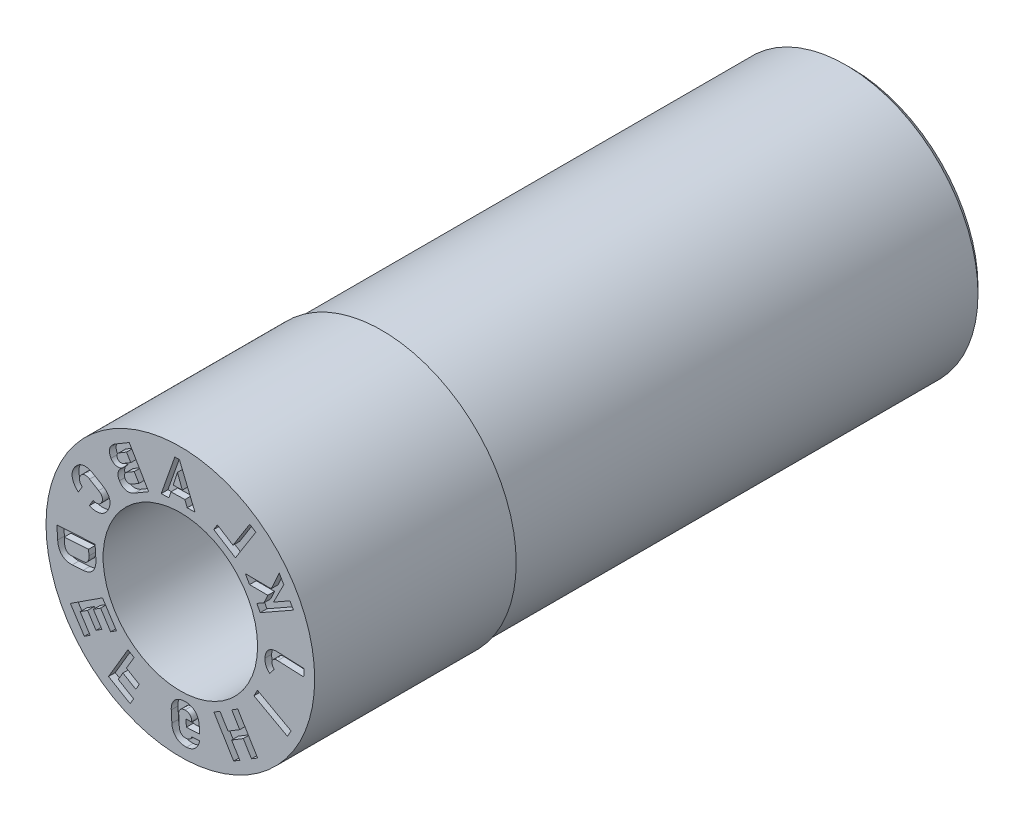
from build123d import *

# Parameters (mm, degrees)
SKETCH4_W          = 14
SKETCH4_H          = 1
CUT_EXTRUDE1_DEPTH = 0.2
CUT_EXTRUDE2_DEPTH = 2


with BuildPart() as part:
    # Sketch1 → Revolve1 (revolve)
    with BuildSketch(Plane(origin=(0, 0, 0), x_dir=(0, 0, -1), z_dir=(1, 0, 0)), mode=Mode.PRIVATE) as revolve1_sk:
        Polygon((0, 4), (0, 2.3), (4, 2.3), (4, 1.25), (16, 1.25), (16, 2), (20, 2), (20, 3.75), (19.75, 4), align=None)
    revolve(revolve1_sk.sketch.rotate(Axis((0, 0, 3.797909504), (0, 0, -1)), 90), axis=Axis((0, 0, 3.797909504), (0, 0, -1)))

    # Sketch4 → Cut-Revolve1 (revolve, cut)
    with BuildSketch(Plane(origin=(0, 0, 0), x_dir=(0, 0, -1), z_dir=(1, 0, 0)), mode=Mode.PRIVATE) as cut_revolve1_sk:
        with Locations((13, 4.435)):
            Rectangle(SKETCH4_W, SKETCH4_H)
    revolve(cut_revolve1_sk.sketch.rotate(Axis((0, 0, 0), (0, 0, -1)), 90), axis=Axis((0, 0, 0), (0, 0, -1)), mode=Mode.SUBTRACT)

    # Sketch2 → Cut-Extrude1 (cut)
    # profile 1 of 12: a face of its own
    with BuildSketch(Plane.XY):
        Polygon((2.773120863, 1.377822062), (3.079891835, 1.977487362), (2.946777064, 2.211889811), (2.705137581, 1.687046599), (1.935571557, 1.693051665), (2.06078152, 1.472021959), (2.60503678, 1.469626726), (2.48840548, 1.216302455), (2.274655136, 1.095041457), (2.380320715, 0.908932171), (3.368128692, 1.469317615), (3.262463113, 1.655426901), align=None)
    # profile 2 of 12: a face of its own
    with BuildSketch(Plane.XY):
        Polygon((2.246873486, 2.917239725), (2.065148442, 3.031646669), (1.568092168, 2.242200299), (1.103482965, 2.534632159), (0.993199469, 2.3594147), (1.639564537, 1.952685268), align=None)
    # profile 3 of 12: a face of its own
    with BuildSketch(Plane.XY):
        Polygon((-2.589112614, -1.491049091), (-2.374599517, -1.351703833), (-2.075388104, -1.812155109), (-1.901737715, -1.699287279), (-2.31797915, -1.058389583), (-3.274642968, -1.679827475), (-2.858401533, -2.320725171), (-2.684751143, -2.207857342), (-2.983901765, -1.747499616), (-2.762793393, -1.603870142), (-2.510613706, -1.992053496), (-2.336963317, -1.879185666), align=None)
    # profile 4 of 12: a face of its own
    with BuildSketch(Plane.XY):
        Polygon((-0.028216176, 3.654319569), (-0.164072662, 3.650803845), (-0.56971503, 2.504084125), (-0.339192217, 2.509922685), (-0.280064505, 2.693516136), (0.136084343, 2.703959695), (0.204476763, 2.523766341), (0.434768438, 2.529593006), align=None)
        Polygon((-0.08722094, 3.292301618), (0.058500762, 2.90836898), (-0.213064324, 2.901553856), align=None, mode=Mode.SUBTRACT)
    # profile 5 of 12: a face of its own
    with BuildSketch(Plane.XY):
        Polygon((-1.605863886, -2.514843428), (-1.376689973, -2.126418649), (-1.561086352, -2.017691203), (-2.138499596, -2.996343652), (-1.495861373, -3.375497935), (-1.39091023, -3.197675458), (-1.849213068, -2.927293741), (-1.710628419, -2.692407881), (-1.326151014, -2.919119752), (-1.221290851, -2.741611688), align=None)
    # profile 6 of 12: a face of its own
    with BuildSketch(Plane.XY):
        Polygon((1.874592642, -2.590216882), (2.118297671, -2.990435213), (2.30047402, -2.879347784), (1.710915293, -1.91116009), (1.528738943, -2.022247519), (1.76755838, -2.414442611), (1.41998856, -2.626161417), (1.181126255, -2.233895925), (0.998641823, -2.345093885), (1.588200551, -3.31328158), (1.770684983, -3.202083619), (1.527022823, -2.801935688), align=None)
    # profile 7 of 12: a face of its own
    with BuildSketch(Plane.XY):
        with BuildLine():
            Line((-1.520922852, 3.345307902), (-1.920069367, 3.110090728))
            add(Edge.make_bspline(
                [(-1.920069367, 3.110090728), (-1.949639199, 3.092858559), (-1.990630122, 3.064116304), (-2.036710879, 3.018950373), (-2.064276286, 2.984333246), (-2.08567769, 2.948012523), (-2.10132748, 2.910434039), (-2.110368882, 2.87150339), (-2.11350859, 2.831622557), (-2.110168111, 2.791021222), (-2.097647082, 2.734608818), (-2.078790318, 2.694190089), (-2.063447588, 2.668192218)],
                knots=[0, 0, 0, 0, 0.194803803, 0.283138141, 0.3663416, 0.445821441, 0.522265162, 0.597030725, 0.67226513, 0.748964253, 0.827957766, 1, 1, 1, 1], degree=3))
            add(Edge.make_bspline(
                [(-2.063447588, 2.668192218), (-2.0528055, 2.650122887), (-2.034558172, 2.624913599), (-2.005037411, 2.597032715), (-1.98164843, 2.579704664), (-1.956392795, 2.566223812), (-1.92990615, 2.555663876), (-1.90182871, 2.549149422), (-1.872490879, 2.545953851), (-1.842077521, 2.546574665), (-1.799202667, 2.551502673), (-1.76752329, 2.561453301), (-1.74644105, 2.569142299)],
                knots=[0, 0, 0, 0, 0.17230749, 0.25342172, 0.332613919, 0.410524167, 0.487832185, 0.566050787, 0.646394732, 0.729514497, 0.815294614, 1, 1, 1, 1], degree=3))
            add(Edge.make_bspline(
                [(-1.74644105, 2.569142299), (-1.765197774, 2.554416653), (-1.790989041, 2.530346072), (-1.818240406, 2.493409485), (-1.834542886, 2.465192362), (-1.846412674, 2.435714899), (-1.854754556, 2.405622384), (-1.858305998, 2.374727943), (-1.857679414, 2.343332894), (-1.853425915, 2.311398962), (-1.840789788, 2.267697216), (-1.826481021, 2.235929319), (-1.814026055, 2.215741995)],
                knots=[0, 0, 0, 0, 0.179878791, 0.263735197, 0.345125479, 0.424727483, 0.502552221, 0.579733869, 0.658108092, 0.738676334, 0.821710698, 1, 1, 1, 1], degree=3))
            Line((-1.814026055, 2.215741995), (-1.812761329, 2.213722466))
            add(Edge.make_bspline(
                [(-1.812761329, 2.213722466), (-1.797333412, 2.18753869), (-1.770808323, 2.151330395), (-1.727641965, 2.112210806), (-1.69319585, 2.089787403), (-1.656642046, 2.073016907), (-1.618030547, 2.062052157), (-1.57737948, 2.057520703), (-1.535055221, 2.058982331), (-1.491219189, 2.066183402), (-1.429322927, 2.084969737), (-1.384229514, 2.106738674), (-1.354788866, 2.124387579)],
                knots=[0, 0, 0, 0, 0.172171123, 0.25196129, 0.328615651, 0.403963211, 0.478875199, 0.554883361, 0.634593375, 0.717961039, 0.805684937, 1, 1, 1, 1], degree=3))
            Line((-1.354788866, 2.124387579), (-0.943972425, 2.366382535))
            Line((-0.943972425, 2.366382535), (-1.520922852, 3.345307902))
        make_face()
        with BuildLine():
            Line((-1.371943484, 2.670933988), (-1.233122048, 2.43539239))
            Line((-1.233122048, 2.43539239), (-1.44183657, 2.312517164))
            add(Edge.make_bspline(
                [(-1.44183657, 2.312517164), (-1.460681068, 2.301403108), (-1.489767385, 2.287871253), (-1.530212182, 2.282338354), (-1.55774876, 2.284253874), (-1.583508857, 2.292184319), (-1.615519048, 2.311461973), (-1.633468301, 2.334184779), (-1.643322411, 2.350733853)],
                knots=[0, 0, 0, 0, 0.283465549, 0.405841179, 0.522925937, 0.636679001, 0.750166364, 1, 1, 1, 1], degree=3))
            Line((-1.643322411, 2.350733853), (-1.644587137, 2.352753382))
            add(Edge.make_bspline(
                [(-1.644587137, 2.352753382), (-1.6516326, 2.364207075), (-1.659378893, 2.382262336), (-1.66545409, 2.407112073), (-1.66663055, 2.425084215), (-1.665208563, 2.442728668), (-1.661117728, 2.459903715), (-1.653985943, 2.47649694), (-1.644320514, 2.492502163), (-1.632053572, 2.507827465), (-1.611838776, 2.527860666), (-1.593497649, 2.540116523), (-1.58072532, 2.548019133)],
                knots=[0, 0, 0, 0, 0.172520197, 0.25125979, 0.328092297, 0.403192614, 0.478338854, 0.554209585, 0.634682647, 0.718250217, 0.806213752, 1, 1, 1, 1], degree=3))
            Line((-1.58072532, 2.548019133), (-1.371943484, 2.670933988))
        make_face(mode=Mode.SUBTRACT)
        with BuildLine():
            Line((-1.476785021, 2.84882109), (-1.685592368, 2.725891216))
            add(Edge.make_bspline(
                [(-1.685592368, 2.725891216), (-1.702756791, 2.715956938), (-1.729192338, 2.703779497), (-1.766061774, 2.699196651), (-1.791198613, 2.701833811), (-1.814832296, 2.709577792), (-1.844342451, 2.728449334), (-1.861287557, 2.749656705), (-1.870447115, 2.765504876)],
                knots=[0, 0, 0, 0, 0.278520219, 0.399106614, 0.515067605, 0.629066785, 0.743549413, 1, 1, 1, 1], degree=3))
            add(Edge.make_bspline(
                [(-1.870447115, 2.765504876), (-1.878630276, 2.779812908), (-1.888059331, 2.802891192), (-1.888578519, 2.835154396), (-1.883081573, 2.858089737), (-1.87220613, 2.879960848), (-1.849545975, 2.908727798), (-1.826340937, 2.925798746), (-1.809255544, 2.935810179)],
                knots=[0, 0, 0, 0, 0.242796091, 0.354569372, 0.467183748, 0.584761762, 0.709338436, 1, 1, 1, 1], degree=3))
            Line((-1.809255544, 2.935810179), (-1.600490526, 3.058715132))
            Line((-1.600490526, 3.058715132), (-1.476785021, 2.84882109))
        make_face(mode=Mode.SUBTRACT)
    # profile 8 of 12: a face of its own
    with BuildSketch(Plane.XY):
        with BuildLine():
            Line((-2.319165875, 1.841108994), (-2.587695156, 2.001253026))
            add(Edge.make_bspline(
                [(-2.587695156, 2.001253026), (-2.606276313, 2.012380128), (-2.634407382, 2.02760861), (-2.67276046, 2.044496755), (-2.700748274, 2.055035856), (-2.728521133, 2.063410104), (-2.755861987, 2.070542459), (-2.783057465, 2.074942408), (-2.809861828, 2.077789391), (-2.836297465, 2.078518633), (-2.862317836, 2.077435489), (-2.887871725, 2.074586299), (-2.912789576, 2.069496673), (-2.937256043, 2.062767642), (-2.961128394, 2.054044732), (-2.984669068, 2.043603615), (-3.007473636, 2.030953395), (-3.029771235, 2.016587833), (-3.051432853, 2.000494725), (-3.072267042, 1.982409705), (-3.092237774, 1.96235799), (-3.111572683, 1.940686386), (-3.136741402, 1.908801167), (-3.153800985, 1.882967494), (-3.164543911, 1.864934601)],
                knots=[0, 0, 0, 0, 0.096418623, 0.142170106, 0.186461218, 0.229442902, 0.271254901, 0.31212696, 0.351940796, 0.391171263, 0.429722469, 0.467793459, 0.505489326, 0.542812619, 0.580645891, 0.618521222, 0.657328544, 0.696599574, 0.736521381, 0.777345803, 0.819284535, 0.86241413, 0.906559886, 1, 1, 1, 1], degree=3))
            add(Edge.make_bspline(
                [(-3.164543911, 1.864934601), (-3.181734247, 1.835526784), (-3.203603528, 1.789627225), (-3.219025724, 1.724824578), (-3.224069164, 1.676705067), (-3.222744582, 1.62848122), (-3.214961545, 1.580535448), (-3.200446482, 1.533174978), (-3.179678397, 1.486481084), (-3.152849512, 1.440626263), (-3.107517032, 1.379632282), (-3.065909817, 1.338552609), (-3.035692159, 1.312715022)],
                knots=[0, 0, 0, 0, 0.164359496, 0.242522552, 0.319818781, 0.396757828, 0.474196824, 0.553044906, 0.634665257, 0.71980849, 0.808406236, 1, 1, 1, 1], degree=3))
            Line((-3.035692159, 1.312715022), (-2.921603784, 1.504172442))
            add(Edge.make_bspline(
                [(-2.921603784, 1.504172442), (-2.934620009, 1.51688371), (-2.953429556, 1.536173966), (-2.973127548, 1.565025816), (-2.985045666, 1.58636544), (-2.99385482, 1.608000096), (-3.000763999, 1.629474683), (-3.004005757, 1.651162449), (-3.005056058, 1.672626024), (-3.003432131, 1.693948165), (-2.996546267, 1.722169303), (-2.987800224, 1.742375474), (-2.980044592, 1.754987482)],
                knots=[0, 0, 0, 0, 0.195176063, 0.286539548, 0.373239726, 0.456219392, 0.536212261, 0.614027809, 0.690102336, 0.765907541, 0.841950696, 1, 1, 1, 1], degree=3))
            add(Edge.make_bspline(
                [(-2.980044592, 1.754987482), (-2.970579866, 1.771208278), (-2.954060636, 1.793318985), (-2.927502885, 1.817241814), (-2.906748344, 1.831189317), (-2.884490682, 1.841265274), (-2.861026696, 1.847730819), (-2.836370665, 1.850587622), (-2.810628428, 1.849929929), (-2.78417199, 1.845117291), (-2.746533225, 1.834511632), (-2.719623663, 1.820358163), (-2.701689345, 1.810109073)],
                knots=[0, 0, 0, 0, 0.174815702, 0.254583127, 0.331751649, 0.406600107, 0.480982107, 0.557388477, 0.636835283, 0.719715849, 0.807055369, 1, 1, 1, 1], degree=3))
            Line((-2.701689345, 1.810109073), (-2.433160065, 1.649965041))
            add(Edge.make_bspline(
                [(-2.433160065, 1.649965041), (-2.415392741, 1.639434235), (-2.390765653, 1.621858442), (-2.363090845, 1.594368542), (-2.34656486, 1.573234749), (-2.333759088, 1.55108345), (-2.324799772, 1.528002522), (-2.319466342, 1.504287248), (-2.317780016, 1.479887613), (-2.320008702, 1.454961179), (-2.328444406, 1.42015497), (-2.340428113, 1.395236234), (-2.349992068, 1.379075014)],
                knots=[0, 0, 0, 0, 0.192501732, 0.280291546, 0.362663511, 0.441768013, 0.517825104, 0.592476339, 0.667438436, 0.744799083, 0.824735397, 1, 1, 1, 1], degree=3))
            add(Edge.make_bspline(
                [(-2.349992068, 1.379075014), (-2.357772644, 1.366274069), (-2.370999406, 1.348227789), (-2.393061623, 1.328850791), (-2.410902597, 1.316839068), (-2.430315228, 1.307351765), (-2.450869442, 1.299710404), (-2.472953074, 1.295610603), (-2.496113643, 1.293406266), (-2.520405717, 1.293705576), (-2.555128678, 1.298114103), (-2.581061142, 1.305420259), (-2.598459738, 1.311384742)],
                knots=[0, 0, 0, 0, 0.160080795, 0.236116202, 0.312169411, 0.388723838, 0.466100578, 0.545220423, 0.627432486, 0.713976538, 0.803688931, 1, 1, 1, 1], degree=3))
            Line((-2.598459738, 1.311384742), (-2.712548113, 1.119927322))
            add(Edge.make_bspline(
                [(-2.712548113, 1.119927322), (-2.675222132, 1.106038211), (-2.619239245, 1.088986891), (-2.543957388, 1.078187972), (-2.490887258, 1.076464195), (-2.439930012, 1.080137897), (-2.391516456, 1.089960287), (-2.345759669, 1.105782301), (-2.302846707, 1.127338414), (-2.262708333, 1.154352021), (-2.213418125, 1.199089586), (-2.182775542, 1.239571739), (-2.165383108, 1.268924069)],
                knots=[0, 0, 0, 0, 0.192101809, 0.280672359, 0.365807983, 0.447541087, 0.526353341, 0.603189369, 0.680187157, 0.757177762, 0.835634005, 1, 1, 1, 1], degree=3))
            add(Edge.make_bspline(
                [(-2.165383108, 1.268924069), (-2.15473105, 1.286978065), (-2.139832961, 1.314207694), (-2.124099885, 1.351637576), (-2.114054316, 1.378904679), (-2.106166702, 1.405980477), (-2.099846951, 1.432814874), (-2.095831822, 1.459466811), (-2.093655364, 1.485898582), (-2.093590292, 1.511925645), (-2.095024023, 1.537546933), (-2.098882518, 1.562701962), (-2.104588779, 1.587403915), (-2.112074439, 1.611740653), (-2.121533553, 1.635559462), (-2.132753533, 1.659039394), (-2.146215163, 1.681831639), (-2.16130186, 1.704210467), (-2.178527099, 1.725735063), (-2.197475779, 1.746682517), (-2.21810028, 1.767021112), (-2.240599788, 1.786695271), (-2.273796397, 1.812287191), (-2.30034515, 1.830236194), (-2.319165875, 1.841108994)],
                knots=[0, 0, 0, 0, 0.093394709, 0.137866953, 0.180684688, 0.222705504, 0.263356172, 0.303339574, 0.342594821, 0.381331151, 0.419141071, 0.456735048, 0.494484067, 0.531939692, 0.569987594, 0.608497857, 0.6476809, 0.687739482, 0.728571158, 0.770310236, 0.813445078, 0.857467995, 0.903296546, 1, 1, 1, 1], degree=3))
        make_face()
    # profile 9 of 12: a face of its own
    with BuildSketch(Plane.XY):
        with BuildLine():
            Line((-3.216653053, -0.656195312), (-2.894321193, -0.635736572))
            add(Edge.make_bspline(
                [(-2.894321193, -0.635736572), (-2.874547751, -0.63434083), (-2.845257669, -0.631369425), (-2.807458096, -0.623120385), (-2.780375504, -0.616171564), (-2.754570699, -0.607089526), (-2.729672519, -0.597127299), (-2.706075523, -0.58513054), (-2.683430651, -0.571859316), (-2.661953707, -0.55705757), (-2.641695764, -0.540810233), (-2.623117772, -0.522806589), (-2.605566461, -0.50365101), (-2.589598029, -0.482774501), (-2.575199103, -0.460305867), (-2.561842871, -0.436531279), (-2.550175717, -0.411156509), (-2.539751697, -0.384496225), (-2.531100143, -0.35645132), (-2.524505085, -0.327025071), (-2.518999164, -0.296333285), (-2.515539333, -0.264251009), (-2.513254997, -0.218952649), (-2.514015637, -0.184341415), (-2.51544457, -0.16089816)],
                knots=[0, 0, 0, 0, 0.086348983, 0.127732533, 0.168294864, 0.207935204, 0.246695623, 0.284917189, 0.323011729, 0.360849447, 0.398333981, 0.435880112, 0.473322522, 0.511310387, 0.550095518, 0.589378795, 0.629886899, 0.671531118, 0.713882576, 0.757464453, 0.802693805, 0.84951751, 0.897781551, 1, 1, 1, 1], degree=3))
            Line((-2.51544457, -0.16089816), (-2.53914282, 0.214517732))
            Line((-2.53914282, 0.214517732), (-3.676222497, 0.142322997))
            Line((-3.676222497, 0.142322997), (-3.652424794, -0.233780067))
            add(Edge.make_bspline(
                [(-3.652424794, -0.233780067), (-3.650998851, -0.256671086), (-3.647481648, -0.290346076), (-3.639646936, -0.334024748), (-3.632331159, -0.364717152), (-3.624014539, -0.394168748), (-3.613805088, -0.422008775), (-3.60254132, -0.448612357), (-3.589761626, -0.473719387), (-3.575654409, -0.497313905), (-3.560200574, -0.519389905), (-3.543526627, -0.53983483), (-3.52542578, -0.558677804), (-3.506197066, -0.575995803), (-3.485480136, -0.591498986), (-3.463856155, -0.605839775), (-3.44065321, -0.618073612), (-3.416361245, -0.628869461), (-3.390975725, -0.638039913), (-3.364509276, -0.645491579), (-3.336962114, -0.651109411), (-3.308330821, -0.654792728), (-3.26813919, -0.65799632), (-3.237401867, -0.657270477), (-3.216653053, -0.656195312)],
                knots=[0, 0, 0, 0, 0.099679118, 0.146986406, 0.192764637, 0.236769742, 0.27990787, 0.321550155, 0.362266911, 0.402245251, 0.44093305, 0.479288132, 0.516785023, 0.554392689, 0.591617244, 0.629153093, 0.667043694, 0.705464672, 0.744616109, 0.784244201, 0.824865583, 0.866685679, 0.909637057, 1, 1, 1, 1], degree=3))
        make_face()
        with BuildLine():
            Line((-2.732134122, -0.012956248), (-2.721584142, -0.179507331))
            add(Edge.make_bspline(
                [(-2.721584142, -0.179507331), (-2.720413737, -0.196159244), (-2.720332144, -0.220578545), (-2.723786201, -0.252036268), (-2.727901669, -0.273639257), (-2.733777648, -0.293866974), (-2.741523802, -0.312682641), (-2.750523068, -0.330288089), (-2.761753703, -0.346113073), (-2.77413382, -0.360719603), (-2.788179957, -0.373490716), (-2.803711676, -0.384408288), (-2.820411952, -0.394011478), (-2.838827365, -0.401539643), (-2.865968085, -0.409068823), (-2.887271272, -0.41259881), (-2.901962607, -0.413276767)],
                knots=[0, 0, 0, 0, 0.149294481, 0.217742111, 0.28276918, 0.345754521, 0.405751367, 0.464545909, 0.522150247, 0.578880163, 0.635526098, 0.69138069, 0.748399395, 0.807472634, 0.868753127, 1, 1, 1, 1], degree=3))
            Line((-2.901962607, -0.413276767), (-3.236796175, -0.434609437))
            add(Edge.make_bspline(
                [(-3.236796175, -0.434609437), (-3.251468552, -0.435396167), (-3.273180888, -0.435374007), (-3.301018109, -0.430780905), (-3.320184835, -0.42554509), (-3.338215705, -0.418551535), (-3.354991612, -0.409497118), (-3.370475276, -0.398475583), (-3.384810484, -0.385798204), (-3.39755393, -0.371209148), (-3.409222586, -0.355227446), (-3.418879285, -0.337377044), (-3.42732735, -0.318111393), (-3.434343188, -0.297301), (-3.441527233, -0.266453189), (-3.444574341, -0.242247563), (-3.445709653, -0.225611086)],
                knots=[0, 0, 0, 0, 0.13151892, 0.193026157, 0.25170786, 0.308849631, 0.365540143, 0.421640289, 0.478418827, 0.536185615, 0.594485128, 0.654943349, 0.717184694, 0.782385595, 0.850943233, 1, 1, 1, 1], degree=3))
            Line((-3.445709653, -0.225611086), (-3.456267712, -0.058932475))
            Line((-3.456267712, -0.058932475), (-2.732134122, -0.012956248))
        make_face(mode=Mode.SUBTRACT)
    # profile 10 of 12: a face of its own
    with BuildSketch(Plane.XY):
        with BuildLine():
            Line((0.573163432, -3.126156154), (0.561754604, -2.904260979))
            add(Edge.make_bspline(
                [(0.561754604, -2.904260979), (0.560998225, -2.883716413), (0.557368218, -2.853545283), (0.550369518, -2.814166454), (0.54300148, -2.786209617), (0.534753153, -2.759056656), (0.524447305, -2.733058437), (0.512655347, -2.708049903), (0.499491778, -2.684019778), (0.484668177, -2.661403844), (0.46886673, -2.639898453), (0.451535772, -2.620105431), (0.4332218, -2.601423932), (0.413285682, -2.584564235), (0.39228093, -2.568966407), (0.370082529, -2.554670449), (0.346534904, -2.542190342), (0.321961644, -2.531156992), (0.296596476, -2.521364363), (0.270200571, -2.513795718), (0.243024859, -2.507905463), (0.215075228, -2.503226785), (0.17608878, -2.500113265), (0.146397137, -2.499551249), (0.126400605, -2.500936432)],
                knots=[0, 0, 0, 0, 0.092096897, 0.136211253, 0.17928166, 0.221700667, 0.2634366, 0.30459319, 0.34567114, 0.386223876, 0.42580974, 0.465274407, 0.504135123, 0.543049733, 0.58225103, 0.621435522, 0.661363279, 0.701668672, 0.742216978, 0.783216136, 0.824693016, 0.866913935, 0.910217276, 1, 1, 1, 1], degree=3))
            add(Edge.make_bspline(
                [(0.126400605, -2.500936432), (0.106248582, -2.501688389), (0.076589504, -2.505175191), (0.037951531, -2.512252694), (0.010430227, -2.519132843), (-0.016093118, -2.527535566), (-0.041567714, -2.537509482), (-0.066273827, -2.548689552), (-0.08974314, -2.561683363), (-0.112037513, -2.576016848), (-0.133302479, -2.59119509), (-0.152709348, -2.608183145), (-0.17113314, -2.625836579), (-0.187660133, -2.645200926), (-0.203102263, -2.665412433), (-0.217239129, -2.686900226), (-0.229481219, -2.709698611), (-0.240507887, -2.733414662), (-0.250035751, -2.757964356), (-0.257435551, -2.783513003), (-0.263579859, -2.809688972), (-0.267894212, -2.836692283), (-0.271485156, -2.874306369), (-0.271412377, -2.903036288), (-0.270372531, -2.922396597)],
                knots=[0, 0, 0, 0, 0.092707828, 0.137257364, 0.180688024, 0.22316353, 0.265200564, 0.306517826, 0.347867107, 0.388513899, 0.428456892, 0.467954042, 0.507098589, 0.5457718, 0.584963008, 0.624107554, 0.663987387, 0.70393038, 0.74441716, 0.785028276, 0.826230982, 0.868081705, 0.910762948, 1, 1, 1, 1], degree=3))
            Line((-0.270372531, -2.922396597), (-0.253045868, -3.257427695))
            add(Edge.make_bspline(
                [(-0.253045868, -3.257427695), (-0.252289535, -3.277972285), (-0.248659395, -3.308143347), (-0.241660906, -3.347522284), (-0.234292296, -3.375478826), (-0.226046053, -3.402632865), (-0.215732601, -3.42862715), (-0.203998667, -3.453586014), (-0.190805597, -3.477443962), (-0.175943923, -3.499867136), (-0.160194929, -3.521318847), (-0.14296242, -3.541131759), (-0.124410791, -3.559557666), (-0.104789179, -3.576698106), (-0.083554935, -3.592009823), (-0.061387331, -3.606311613), (-0.037932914, -3.619058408), (-0.013347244, -3.63011106), (0.012100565, -3.639583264), (0.038369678, -3.647169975), (0.065523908, -3.653187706), (0.093422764, -3.657709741), (0.132390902, -3.660972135), (0.162017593, -3.66143559), (0.182010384, -3.660083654)],
                knots=[0, 0, 0, 0, 0.092204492, 0.136370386, 0.17949111, 0.221959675, 0.263744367, 0.304949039, 0.345757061, 0.386050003, 0.425682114, 0.465192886, 0.503831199, 0.543041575, 0.582057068, 0.621287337, 0.66145496, 0.701807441, 0.74225055, 0.783297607, 0.824493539, 0.86709897, 0.910112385, 1, 1, 1, 1], degree=3))
            add(Edge.make_bspline(
                [(0.182010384, -3.660083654), (0.214847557, -3.65872718), (0.263268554, -3.650782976), (0.324614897, -3.63014817), (0.367601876, -3.609659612), (0.407433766, -3.584317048), (0.443986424, -3.554815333), (0.476642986, -3.520973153), (0.505321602, -3.483193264), (0.529719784, -3.441999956), (0.555911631, -3.38224464), (0.568280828, -3.334364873), (0.572825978, -3.301525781)],
                knots=[0, 0, 0, 0, 0.170672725, 0.253470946, 0.33582005, 0.417619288, 0.498386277, 0.579483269, 0.661511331, 0.744467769, 0.827803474, 1, 1, 1, 1], degree=3))
            Line((0.572825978, -3.301525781), (0.341694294, -3.313602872))
            add(Edge.make_bspline(
                [(0.341694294, -3.313602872), (0.338297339, -3.32541815), (0.331927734, -3.342956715), (0.318355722, -3.363555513), (0.306834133, -3.378024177), (0.293357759, -3.390997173), (0.278367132, -3.402241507), (0.26255821, -3.412733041), (0.245212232, -3.420948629), (0.227199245, -3.427763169), (0.202464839, -3.435031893), (0.183234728, -3.437395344), (0.170371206, -3.438210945)],
                knots=[0, 0, 0, 0, 0.163455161, 0.244228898, 0.325903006, 0.408112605, 0.491213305, 0.573954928, 0.659012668, 0.744804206, 0.829003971, 1, 1, 1, 1], degree=3))
            add(Edge.make_bspline(
                [(0.170371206, -3.438210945), (0.15243383, -3.439056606), (0.125633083, -3.43801048), (0.09196207, -3.428722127), (0.068682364, -3.419171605), (0.047416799, -3.406285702), (0.028287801, -3.390644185), (0.011716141, -3.372087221), (-0.002810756, -3.351184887), (-0.014114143, -3.327573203), (-0.026787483, -3.29304521), (-0.02995542, -3.264931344), (-0.031381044, -3.246041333)],
                knots=[0, 0, 0, 0, 0.172172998, 0.253423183, 0.332967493, 0.412052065, 0.490299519, 0.568351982, 0.649249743, 0.732830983, 0.817998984, 1, 1, 1, 1], degree=3))
            Line((-0.031381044, -3.246041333), (-0.048707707, -2.911010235))
            add(Edge.make_bspline(
                [(-0.048707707, -2.911010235), (-0.049892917, -2.894170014), (-0.048093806, -2.869204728), (-0.03944791, -2.837600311), (-0.029919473, -2.815879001), (-0.017317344, -2.796046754), (-0.002315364, -2.778001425), (0.015880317, -2.762766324), (0.036288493, -2.749548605), (0.058948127, -2.738841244), (0.092568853, -2.727427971), (0.11965453, -2.724140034), (0.138039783, -2.722809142)],
                knots=[0, 0, 0, 0, 0.169384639, 0.249139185, 0.328273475, 0.406732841, 0.484577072, 0.563070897, 0.644199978, 0.728311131, 0.814245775, 1, 1, 1, 1], degree=3))
            add(Edge.make_bspline(
                [(0.138039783, -2.722809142), (0.156208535, -2.72195812), (0.183169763, -2.722969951), (0.217327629, -2.731448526), (0.240559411, -2.740754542), (0.261750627, -2.753077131), (0.280936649, -2.767986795), (0.297377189, -2.786257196), (0.311563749, -2.806970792), (0.322839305, -2.83036017), (0.334966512, -2.865283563), (0.338547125, -2.893639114), (0.339589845, -2.912905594)],
                knots=[0, 0, 0, 0, 0.174321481, 0.255810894, 0.335716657, 0.412952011, 0.489702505, 0.567216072, 0.647166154, 0.729162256, 0.814929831, 1, 1, 1, 1], degree=3))
            Line((0.339589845, -2.912905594), (0.340718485, -2.931631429))
            Line((0.340718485, -2.931631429), (0.169034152, -2.940468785))
            Line((0.169034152, -2.940468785), (0.179606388, -3.14663269))
            Line((0.179606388, -3.14663269), (0.573163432, -3.126156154))
        make_face()
    # profile 11 of 12: a face of its own
    with BuildSketch(Plane.XY):
        Polygon((2.29809431, -1.133911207), (2.191087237, -1.328847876), (3.189790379, -1.876554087), (3.296797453, -1.681617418), align=None)
    # profile 12 of 12: a face of its own
    with BuildSketch(Plane.XY):
        with BuildLine():
            Line((2.661786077, -0.51335561), (2.796408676, -0.343859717))
            add(Edge.make_bspline(
                [(2.796408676, -0.343859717), (2.785030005, -0.334398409), (2.769819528, -0.318187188), (2.753502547, -0.29369975), (2.743597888, -0.27416434), (2.735821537, -0.25389847), (2.72894961, -0.226124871), (2.727147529, -0.204794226), (2.727965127, -0.190615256)],
                knots=[0, 0, 0, 0, 0.255231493, 0.381315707, 0.506998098, 0.632722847, 0.755324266, 1, 1, 1, 1], degree=3))
            add(Edge.make_bspline(
                [(2.727965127, -0.190615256), (2.728750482, -0.172101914), (2.734280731, -0.144287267), (2.755035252, -0.114151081), (2.775179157, -0.095961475), (2.800291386, -0.082299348), (2.841756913, -0.069822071), (2.875762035, -0.0676387), (2.899317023, -0.068919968)],
                knots=[0, 0, 0, 0, 0.235578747, 0.34493456, 0.456480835, 0.57496348, 0.702365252, 1, 1, 1, 1], degree=3))
            Line((2.899317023, -0.068919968), (3.673301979, -0.102106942))
            Line((3.673301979, -0.102106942), (3.682835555, 0.119624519))
            Line((3.682835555, 0.119624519), (2.907928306, 0.152891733))
            add(Edge.make_bspline(
                [(2.907928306, 0.152891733), (2.871279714, 0.154766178), (2.817657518, 0.152032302), (2.749753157, 0.137101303), (2.711828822, 0.122912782), (2.683736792, 0.109064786), (2.664251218, 0.097164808), (2.645506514, 0.084577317), (2.628554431, 0.070023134), (2.61245758, 0.054673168), (2.5974227, 0.038060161), (2.58388959, 0.019947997), (2.571421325, 0.000730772), (2.560413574, -0.019703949), (2.550571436, -0.041264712), (2.542187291, -0.063925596), (2.534949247, -0.087646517), (2.529103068, -0.112514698), (2.522935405, -0.147769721), (2.520413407, -0.17496771), (2.519566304, -0.193392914)],
                knots=[0, 0, 0, 0, 0.185996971, 0.270621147, 0.351640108, 0.390621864, 0.429278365, 0.467346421, 0.504967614, 0.542395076, 0.580107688, 0.618424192, 0.65692399, 0.69616986, 0.736011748, 0.777014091, 0.81860016, 0.861698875, 0.906467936, 1, 1, 1, 1], degree=3))
            add(Edge.make_bspline(
                [(2.519566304, -0.193392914), (2.518187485, -0.226555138), (2.520799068, -0.275653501), (2.535123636, -0.338351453), (2.551210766, -0.381366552), (2.571845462, -0.421031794), (2.605753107, -0.468208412), (2.637903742, -0.497519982), (2.661786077, -0.51335561)],
                knots=[0, 0, 0, 0, 0.271973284, 0.400311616, 0.52557417, 0.647267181, 0.76561072, 1, 1, 1, 1], degree=3))
        make_face()
    extrude(amount=-CUT_EXTRUDE1_DEPTH, mode=Mode.SUBTRACT)

    # Sketch3 → Cut-Extrude2 (cut)
    with BuildSketch(Plane.XY.offset(-4)):
        Polygon((0.721687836, 1.25), (-0.721687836, 1.25), (-1.443375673, 0), (-0.721687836, -1.25), (0.721687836, -1.25), (1.443375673, 0), align=None)
    extrude(amount=-CUT_EXTRUDE2_DEPTH, mode=Mode.SUBTRACT)


solid = part.part
